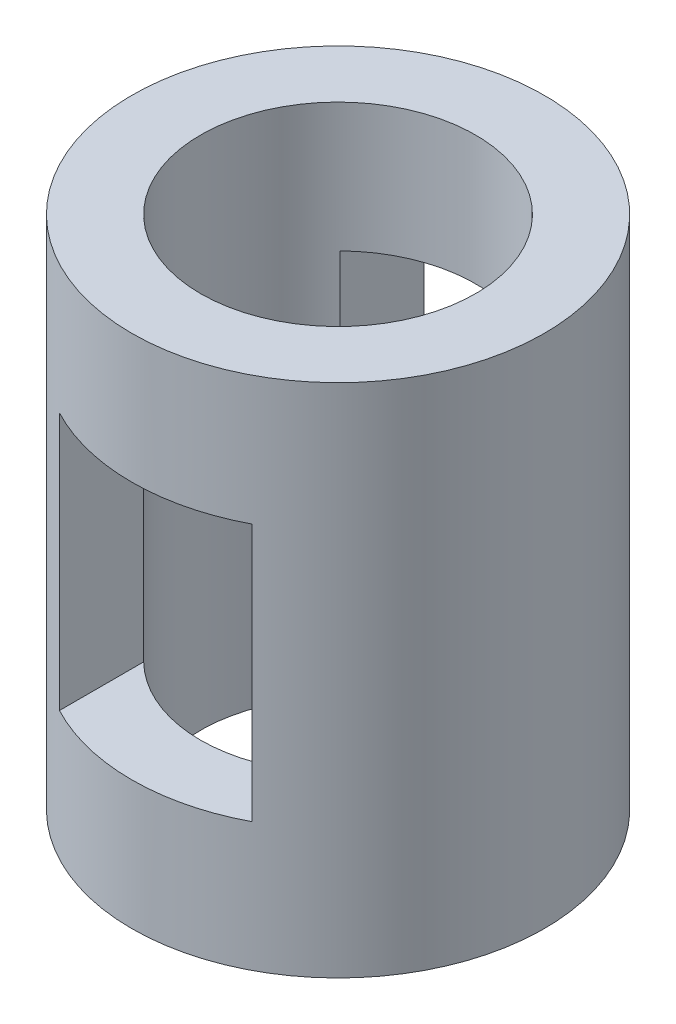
ISO-10303-21;
HEADER;
FILE_DESCRIPTION(('STEP AP214'),'2;1');
FILE_NAME('part.step','',(''),(''),'','','');
FILE_SCHEMA(('AUTOMOTIVE_DESIGN { 1 0 10303 214 1 1 1 1 }'));
ENDSEC;
DATA;
#1=APPLICATION_CONTEXT('core data for automotive mechanical design processes');
#2=APPLICATION_PROTOCOL_DEFINITION('international standard','automotive_design',2000,#1);
#3=PRODUCT_CONTEXT('',#1,'mechanical');
#4=PRODUCT('Part','Part','',(#3));
#5=PRODUCT_RELATED_PRODUCT_CATEGORY('part','',(#4));
#6=PRODUCT_DEFINITION_FORMATION('','',#4);
#7=PRODUCT_DEFINITION_CONTEXT('part definition',#1,'design');
#8=PRODUCT_DEFINITION('design','',#6,#7);
#9=PRODUCT_DEFINITION_SHAPE('','',#8);
#10=(LENGTH_UNIT() NAMED_UNIT(*) SI_UNIT(.MILLI.,.METRE.));
#11=(NAMED_UNIT(*) PLANE_ANGLE_UNIT() SI_UNIT($,.RADIAN.));
#12=(NAMED_UNIT(*) SI_UNIT($,.STERADIAN.) SOLID_ANGLE_UNIT());
#13=UNCERTAINTY_MEASURE_WITH_UNIT(LENGTH_MEASURE(1.E-05),#10,'distance_accuracy_value','');
#14=(GEOMETRIC_REPRESENTATION_CONTEXT(3) GLOBAL_UNCERTAINTY_ASSIGNED_CONTEXT((#13)) GLOBAL_UNIT_ASSIGNED_CONTEXT((#10,
#11,#12)) REPRESENTATION_CONTEXT('',''));
#15=CARTESIAN_POINT('',(0.,0.,0.));
#16=DIRECTION('',(0.,0.,1.));
#17=DIRECTION('',(1.,0.,0.));
#18=AXIS2_PLACEMENT_3D('',#15,#16,#17);
#19=CARTESIAN_POINT('',(-14.,56.25,-30.));
#20=DIRECTION('',(-1.,0.,0.));
#21=DIRECTION('',(0.,-1.,0.));
#22=AXIS2_PLACEMENT_3D('',#19,#20,#21);
#23=PLANE('',#22);
#24=DIRECTION('',(0.,0.,1.));
#25=VECTOR('',#24,1.);
#26=CARTESIAN_POINT('',(-14.,18.75,-30.));
#27=LINE('',#26,#25);
#28=CARTESIAN_POINT('',(-14.,18.75,14.2828568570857));
#29=VERTEX_POINT('',#28);
#30=CARTESIAN_POINT('',(-14.,18.75,26.5329983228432));
#31=VERTEX_POINT('',#30);
#32=EDGE_CURVE('E115',#29,#31,#27,.T.);
#33=ORIENTED_EDGE('',*,*,#32,.F.);
#34=DIRECTION('',(0.,1.,0.));
#35=VECTOR('',#34,1.);
#36=CARTESIAN_POINT('',(-14.,0.,14.2828568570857));
#37=LINE('',#36,#35);
#38=CARTESIAN_POINT('',(-14.,56.25,14.2828568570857));
#39=VERTEX_POINT('',#38);
#40=EDGE_CURVE('E45',#29,#39,#37,.T.);
#41=ORIENTED_EDGE('',*,*,#40,.T.);
#42=DIRECTION('',(0.,0.,1.));
#43=VECTOR('',#42,1.);
#44=CARTESIAN_POINT('',(-14.,56.25,-30.));
#45=LINE('',#44,#43);
#46=CARTESIAN_POINT('',(-14.,56.25,26.5329983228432));
#47=VERTEX_POINT('',#46);
#48=EDGE_CURVE('E156',#39,#47,#45,.T.);
#49=ORIENTED_EDGE('',*,*,#48,.T.);
#50=DIRECTION('',(0.,-1.,0.));
#51=VECTOR('',#50,1.);
#52=CARTESIAN_POINT('',(-14.,75.,26.5329983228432));
#53=LINE('',#52,#51);
#54=EDGE_CURVE('E133',#31,#47,#53,.F.);
#55=ORIENTED_EDGE('',*,*,#54,.F.);
#56=EDGE_LOOP('',(#33,#41,#49,#55));
#57=FACE_BOUND('',#56,.T.);
#58=ADVANCED_FACE('F30',(#57),#23,.F.);
#59=CARTESIAN_POINT('',(-14.,56.25,-30.));
#60=DIRECTION('',(0.,1.,0.));
#61=DIRECTION('',(0.,0.,1.));
#62=AXIS2_PLACEMENT_3D('',#59,#60,#61);
#63=PLANE('',#62);
#64=DIRECTION('',(0.,0.,1.));
#65=VECTOR('',#64,1.);
#66=CARTESIAN_POINT('',(14.,56.25,-30.));
#67=LINE('',#66,#65);
#68=CARTESIAN_POINT('',(14.,56.25,-26.5329983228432));
#69=VERTEX_POINT('',#68);
#70=CARTESIAN_POINT('',(14.,56.25,-14.2828568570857));
#71=VERTEX_POINT('',#70);
#72=EDGE_CURVE('E150',#69,#71,#67,.T.);
#73=ORIENTED_EDGE('',*,*,#72,.T.);
#74=CARTESIAN_POINT('',(0.,56.25,0.));
#75=DIRECTION('',(0.,1.,0.));
#76=DIRECTION('',(0.,0.,1.));
#77=AXIS2_PLACEMENT_3D('',#74,#75,#76);
#78=CIRCLE('',#77,20.);
#79=CARTESIAN_POINT('',(-14.,56.25,-14.2828568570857));
#80=VERTEX_POINT('',#79);
#81=EDGE_CURVE('E110',#71,#80,#78,.T.);
#82=ORIENTED_EDGE('',*,*,#81,.T.);
#83=CARTESIAN_POINT('',(-14.,56.25,-26.5329983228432));
#84=VERTEX_POINT('',#83);
#85=EDGE_CURVE('E108',#84,#80,#45,.T.);
#86=ORIENTED_EDGE('',*,*,#85,.F.);
#87=CARTESIAN_POINT('',(0.,56.25,0.));
#88=DIRECTION('',(0.,1.,0.));
#89=DIRECTION('',(0.,0.,1.));
#90=AXIS2_PLACEMENT_3D('',#87,#88,#89);
#91=CIRCLE('',#90,30.);
#92=EDGE_CURVE('E134',#69,#84,#91,.T.);
#93=ORIENTED_EDGE('',*,*,#92,.F.);
#94=EDGE_LOOP('',(#73,#82,#86,#93));
#95=FACE_BOUND('',#94,.T.);
#96=ADVANCED_FACE('F192',(#95),#63,.F.);
#97=CARTESIAN_POINT('',(14.,56.25,-30.));
#98=DIRECTION('',(1.,0.,0.));
#99=DIRECTION('',(0.,1.,0.));
#100=AXIS2_PLACEMENT_3D('',#97,#98,#99);
#101=PLANE('',#100);
#102=DIRECTION('',(0.,0.,1.));
#103=VECTOR('',#102,1.);
#104=CARTESIAN_POINT('',(14.,18.75,-30.));
#105=LINE('',#104,#103);
#106=CARTESIAN_POINT('',(14.,18.75,-26.5329983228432));
#107=VERTEX_POINT('',#106);
#108=CARTESIAN_POINT('',(14.,18.75,-14.2828568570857));
#109=VERTEX_POINT('',#108);
#110=EDGE_CURVE('E117',#107,#109,#105,.T.);
#111=ORIENTED_EDGE('',*,*,#110,.T.);
#112=DIRECTION('',(0.,1.,0.));
#113=VECTOR('',#112,1.);
#114=CARTESIAN_POINT('',(14.,0.,-14.2828568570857));
#115=LINE('',#114,#113);
#116=EDGE_CURVE('E52',#109,#71,#115,.T.);
#117=ORIENTED_EDGE('',*,*,#116,.T.);
#118=ORIENTED_EDGE('',*,*,#72,.F.);
#119=DIRECTION('',(0.,-1.,0.));
#120=VECTOR('',#119,1.);
#121=CARTESIAN_POINT('',(14.,75.,-26.5329983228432));
#122=LINE('',#121,#120);
#123=EDGE_CURVE('E100',#107,#69,#122,.F.);
#124=ORIENTED_EDGE('',*,*,#123,.F.);
#125=EDGE_LOOP('',(#111,#117,#118,#124));
#126=FACE_BOUND('',#125,.T.);
#127=ADVANCED_FACE('F148',(#126),#101,.F.);
#128=CARTESIAN_POINT('',(-14.,18.75,-30.));
#129=DIRECTION('',(0.,-1.,0.));
#130=DIRECTION('',(0.,0.,-1.));
#131=AXIS2_PLACEMENT_3D('',#128,#129,#130);
#132=PLANE('',#131);
#133=CARTESIAN_POINT('',(14.,18.75,14.2828568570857));
#134=VERTEX_POINT('',#133);
#135=CARTESIAN_POINT('',(14.,18.75,26.5329983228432));
#136=VERTEX_POINT('',#135);
#137=EDGE_CURVE('E114',#134,#136,#105,.T.);
#138=ORIENTED_EDGE('',*,*,#137,.F.);
#139=CARTESIAN_POINT('',(0.,18.75,0.));
#140=DIRECTION('',(0.,-1.,0.));
#141=DIRECTION('',(0.,0.,-1.));
#142=AXIS2_PLACEMENT_3D('',#139,#140,#141);
#143=CIRCLE('',#142,20.);
#144=EDGE_CURVE('E11',#134,#29,#143,.T.);
#145=ORIENTED_EDGE('',*,*,#144,.T.);
#146=ORIENTED_EDGE('',*,*,#32,.T.);
#147=CARTESIAN_POINT('',(0.,18.75,0.));
#148=DIRECTION('',(0.,-1.,0.));
#149=DIRECTION('',(0.,0.,-1.));
#150=AXIS2_PLACEMENT_3D('',#147,#148,#149);
#151=CIRCLE('',#150,30.);
#152=EDGE_CURVE('E124',#136,#31,#151,.T.);
#153=ORIENTED_EDGE('',*,*,#152,.F.);
#154=EDGE_LOOP('',(#138,#145,#146,#153));
#155=FACE_BOUND('',#154,.T.);
#156=ADVANCED_FACE('F185',(#155),#132,.F.);
#157=CARTESIAN_POINT('',(0.,75.,0.));
#158=DIRECTION('',(0.,-1.,0.));
#159=DIRECTION('',(0.,0.,-1.));
#160=AXIS2_PLACEMENT_3D('',#157,#158,#159);
#161=CYLINDRICAL_SURFACE('',#160,30.);
#162=ORIENTED_EDGE('',*,*,#123,.T.);
#163=ORIENTED_EDGE('',*,*,#92,.T.);
#164=DIRECTION('',(0.,-1.,0.));
#165=VECTOR('',#164,1.);
#166=CARTESIAN_POINT('',(-14.,75.,-26.5329983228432));
#167=LINE('',#166,#165);
#168=CARTESIAN_POINT('',(-14.,18.75,-26.5329983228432));
#169=VERTEX_POINT('',#168);
#170=EDGE_CURVE('E137',#84,#169,#167,.T.);
#171=ORIENTED_EDGE('',*,*,#170,.T.);
#172=EDGE_CURVE('E113',#169,#107,#151,.T.);
#173=ORIENTED_EDGE('',*,*,#172,.T.);
#174=EDGE_LOOP('',(#162,#163,#171,#173));
#175=FACE_BOUND('',#174,.T.);
#176=CARTESIAN_POINT('',(14.,56.25,26.5329983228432));
#177=VERTEX_POINT('',#176);
#178=EDGE_CURVE('E130',#47,#177,#91,.T.);
#179=ORIENTED_EDGE('',*,*,#178,.T.);
#180=DIRECTION('',(0.,-1.,0.));
#181=VECTOR('',#180,1.);
#182=CARTESIAN_POINT('',(14.,75.,26.5329983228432));
#183=LINE('',#182,#181);
#184=EDGE_CURVE('E139',#177,#136,#183,.T.);
#185=ORIENTED_EDGE('',*,*,#184,.T.);
#186=ORIENTED_EDGE('',*,*,#152,.T.);
#187=ORIENTED_EDGE('',*,*,#54,.T.);
#188=EDGE_LOOP('',(#179,#185,#186,#187));
#189=FACE_BOUND('',#188,.T.);
#190=CARTESIAN_POINT('',(0.,75.,0.));
#191=DIRECTION('',(0.,1.,0.));
#192=DIRECTION('',(0.,0.,1.));
#193=AXIS2_PLACEMENT_3D('',#190,#191,#192);
#194=CIRCLE('',#193,30.);
#195=CARTESIAN_POINT('',(0.,75.,30.));
#196=VERTEX_POINT('',#195);
#197=EDGE_CURVE('E121',#196,#196,#194,.T.);
#198=ORIENTED_EDGE('',*,*,#197,.F.);
#199=EDGE_LOOP('',(#198));
#200=FACE_BOUND('',#199,.T.);
#201=CARTESIAN_POINT('',(0.,0.,0.));
#202=DIRECTION('',(0.,1.,0.));
#203=DIRECTION('',(0.,0.,1.));
#204=AXIS2_PLACEMENT_3D('',#201,#202,#203);
#205=CIRCLE('',#204,30.);
#206=CARTESIAN_POINT('',(0.,0.,30.));
#207=VERTEX_POINT('',#206);
#208=EDGE_CURVE('E125',#207,#207,#205,.T.);
#209=ORIENTED_EDGE('',*,*,#208,.T.);
#210=EDGE_LOOP('',(#209));
#211=FACE_BOUND('',#210,.T.);
#212=ADVANCED_FACE('F32',(#175,#189,#200,#211),#161,.T.);
#213=CARTESIAN_POINT('',(0.,75.,0.));
#214=DIRECTION('',(0.,1.,0.));
#215=DIRECTION('',(0.,0.,1.));
#216=AXIS2_PLACEMENT_3D('',#213,#214,#215);
#217=PLANE('',#216);
#218=CARTESIAN_POINT('',(0.,75.,0.));
#219=DIRECTION('',(0.,1.,0.));
#220=DIRECTION('',(0.,0.,1.));
#221=AXIS2_PLACEMENT_3D('',#218,#219,#220);
#222=CIRCLE('',#221,20.);
#223=CARTESIAN_POINT('',(0.,75.,20.));
#224=VERTEX_POINT('',#223);
#225=EDGE_CURVE('E166',#224,#224,#222,.T.);
#226=ORIENTED_EDGE('',*,*,#225,.F.);
#227=EDGE_LOOP('',(#226));
#228=FACE_BOUND('',#227,.T.);
#229=ORIENTED_EDGE('',*,*,#197,.T.);
#230=EDGE_LOOP('',(#229));
#231=FACE_BOUND('',#230,.T.);
#232=ADVANCED_FACE('F206',(#228,#231),#217,.T.);
#233=CARTESIAN_POINT('',(0.,0.,0.));
#234=DIRECTION('',(0.,1.,0.));
#235=DIRECTION('',(0.,0.,1.));
#236=AXIS2_PLACEMENT_3D('',#233,#234,#235);
#237=PLANE('',#236);
#238=CARTESIAN_POINT('',(0.,0.,0.));
#239=DIRECTION('',(0.,1.,0.));
#240=DIRECTION('',(0.,0.,1.));
#241=AXIS2_PLACEMENT_3D('',#238,#239,#240);
#242=CIRCLE('',#241,20.);
#243=CARTESIAN_POINT('',(0.,0.,20.));
#244=VERTEX_POINT('',#243);
#245=EDGE_CURVE('E165',#244,#244,#242,.T.);
#246=ORIENTED_EDGE('',*,*,#245,.T.);
#247=EDGE_LOOP('',(#246));
#248=FACE_BOUND('',#247,.T.);
#249=ORIENTED_EDGE('',*,*,#208,.F.);
#250=EDGE_LOOP('',(#249));
#251=FACE_BOUND('',#250,.T.);
#252=ADVANCED_FACE('F172',(#248,#251),#237,.F.);
#253=ORIENTED_EDGE('',*,*,#85,.T.);
#254=DIRECTION('',(0.,1.,0.));
#255=VECTOR('',#254,1.);
#256=CARTESIAN_POINT('',(-14.,0.,-14.2828568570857));
#257=LINE('',#256,#255);
#258=CARTESIAN_POINT('',(-14.,18.75,-14.2828568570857));
#259=VERTEX_POINT('',#258);
#260=EDGE_CURVE('E94',#80,#259,#257,.F.);
#261=ORIENTED_EDGE('',*,*,#260,.T.);
#262=EDGE_CURVE('E105',#169,#259,#27,.T.);
#263=ORIENTED_EDGE('',*,*,#262,.F.);
#264=ORIENTED_EDGE('',*,*,#170,.F.);
#265=EDGE_LOOP('',(#253,#261,#263,#264));
#266=FACE_BOUND('',#265,.T.);
#267=ADVANCED_FACE('F104',(#266),#23,.F.);
#268=ORIENTED_EDGE('',*,*,#48,.F.);
#269=CARTESIAN_POINT('',(14.,56.25,14.2828568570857));
#270=VERTEX_POINT('',#269);
#271=EDGE_CURVE('E160',#39,#270,#78,.T.);
#272=ORIENTED_EDGE('',*,*,#271,.T.);
#273=EDGE_CURVE('E151',#270,#177,#67,.T.);
#274=ORIENTED_EDGE('',*,*,#273,.T.);
#275=ORIENTED_EDGE('',*,*,#178,.F.);
#276=EDGE_LOOP('',(#268,#272,#274,#275));
#277=FACE_BOUND('',#276,.T.);
#278=ADVANCED_FACE('F189',(#277),#63,.F.);
#279=ORIENTED_EDGE('',*,*,#273,.F.);
#280=DIRECTION('',(0.,1.,0.));
#281=VECTOR('',#280,1.);
#282=CARTESIAN_POINT('',(14.,0.,14.2828568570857));
#283=LINE('',#282,#281);
#284=EDGE_CURVE('E109',#270,#134,#283,.F.);
#285=ORIENTED_EDGE('',*,*,#284,.T.);
#286=ORIENTED_EDGE('',*,*,#137,.T.);
#287=ORIENTED_EDGE('',*,*,#184,.F.);
#288=EDGE_LOOP('',(#279,#285,#286,#287));
#289=FACE_BOUND('',#288,.T.);
#290=ADVANCED_FACE('F182',(#289),#101,.F.);
#291=ORIENTED_EDGE('',*,*,#262,.T.);
#292=EDGE_CURVE('E34',#259,#109,#143,.T.);
#293=ORIENTED_EDGE('',*,*,#292,.T.);
#294=ORIENTED_EDGE('',*,*,#110,.F.);
#295=ORIENTED_EDGE('',*,*,#172,.F.);
#296=EDGE_LOOP('',(#291,#293,#294,#295));
#297=FACE_BOUND('',#296,.T.);
#298=ADVANCED_FACE('F112',(#297),#132,.F.);
#299=CARTESIAN_POINT('',(0.,0.,0.));
#300=DIRECTION('',(0.,1.,0.));
#301=DIRECTION('',(0.,0.,1.));
#302=AXIS2_PLACEMENT_3D('',#299,#300,#301);
#303=CYLINDRICAL_SURFACE('',#302,20.);
#304=ORIENTED_EDGE('',*,*,#81,.F.);
#305=ORIENTED_EDGE('',*,*,#116,.F.);
#306=ORIENTED_EDGE('',*,*,#292,.F.);
#307=ORIENTED_EDGE('',*,*,#260,.F.);
#308=EDGE_LOOP('',(#304,#305,#306,#307));
#309=FACE_BOUND('',#308,.T.);
#310=ORIENTED_EDGE('',*,*,#245,.F.);
#311=EDGE_LOOP('',(#310));
#312=FACE_BOUND('',#311,.T.);
#313=ORIENTED_EDGE('',*,*,#225,.T.);
#314=EDGE_LOOP('',(#313));
#315=FACE_BOUND('',#314,.T.);
#316=ORIENTED_EDGE('',*,*,#144,.F.);
#317=ORIENTED_EDGE('',*,*,#284,.F.);
#318=ORIENTED_EDGE('',*,*,#271,.F.);
#319=ORIENTED_EDGE('',*,*,#40,.F.);
#320=EDGE_LOOP('',(#316,#317,#318,#319));
#321=FACE_BOUND('',#320,.T.);
#322=ADVANCED_FACE('F92',(#309,#312,#315,#321),#303,.F.);
#323=CLOSED_SHELL('',(#58,#96,#127,#156,#212,#232,#252,#267,#278,#290,#298,#322));
#324=MANIFOLD_SOLID_BREP('B2',#323);
#325=ADVANCED_BREP_SHAPE_REPRESENTATION('',(#18,#324),#14);
#326=SHAPE_DEFINITION_REPRESENTATION(#9,#325);
ENDSEC;
END-ISO-10303-21;
